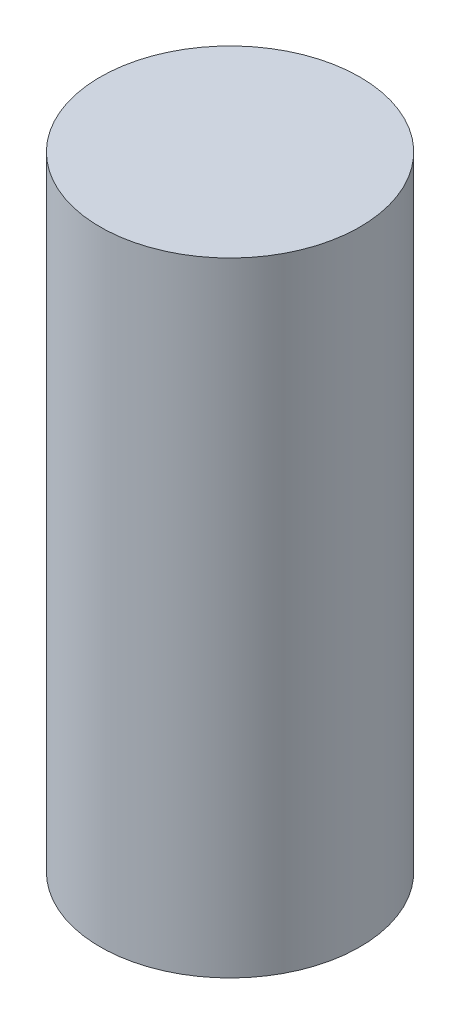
ISO-10303-21;
HEADER;
FILE_DESCRIPTION(('STEP AP214'),'2;1');
FILE_NAME('part.step','',(''),(''),'','','');
FILE_SCHEMA(('AUTOMOTIVE_DESIGN { 1 0 10303 214 1 1 1 1 }'));
ENDSEC;
DATA;
#1=APPLICATION_CONTEXT('core data for automotive mechanical design processes');
#2=APPLICATION_PROTOCOL_DEFINITION('international standard','automotive_design',2000,#1);
#3=PRODUCT_CONTEXT('',#1,'mechanical');
#4=PRODUCT('Part','Part','',(#3));
#5=PRODUCT_RELATED_PRODUCT_CATEGORY('part','',(#4));
#6=PRODUCT_DEFINITION_FORMATION('','',#4);
#7=PRODUCT_DEFINITION_CONTEXT('part definition',#1,'design');
#8=PRODUCT_DEFINITION('design','',#6,#7);
#9=PRODUCT_DEFINITION_SHAPE('','',#8);
#10=(LENGTH_UNIT() NAMED_UNIT(*) SI_UNIT(.MILLI.,.METRE.));
#11=(NAMED_UNIT(*) PLANE_ANGLE_UNIT() SI_UNIT($,.RADIAN.));
#12=(NAMED_UNIT(*) SI_UNIT($,.STERADIAN.) SOLID_ANGLE_UNIT());
#13=UNCERTAINTY_MEASURE_WITH_UNIT(LENGTH_MEASURE(1.E-05),#10,'distance_accuracy_value','');
#14=(GEOMETRIC_REPRESENTATION_CONTEXT(3) GLOBAL_UNCERTAINTY_ASSIGNED_CONTEXT((#13)) GLOBAL_UNIT_ASSIGNED_CONTEXT((#10,
#11,#12)) REPRESENTATION_CONTEXT('',''));
#15=CARTESIAN_POINT('',(0.,0.,0.));
#16=DIRECTION('',(0.,0.,1.));
#17=DIRECTION('',(1.,0.,0.));
#18=AXIS2_PLACEMENT_3D('',#15,#16,#17);
#19=CARTESIAN_POINT('',(0.,38.1,0.));
#20=DIRECTION('',(0.,-1.,0.));
#21=DIRECTION('',(0.,0.,-1.));
#22=AXIS2_PLACEMENT_3D('',#19,#20,#21);
#23=CYLINDRICAL_SURFACE('',#22,7.9375);
#24=CARTESIAN_POINT('',(0.,38.1,0.));
#25=DIRECTION('',(0.,1.,0.));
#26=DIRECTION('',(0.,0.,1.));
#27=AXIS2_PLACEMENT_3D('',#24,#25,#26);
#28=CIRCLE('',#27,7.9375);
#29=CARTESIAN_POINT('',(0.,38.1,-7.9375));
#30=VERTEX_POINT('',#29);
#31=EDGE_CURVE('E10',#30,#30,#28,.T.);
#32=CARTESIAN_POINT('',(0.,0.,0.));
#33=DIRECTION('',(0.,1.,0.));
#34=DIRECTION('',(0.,0.,1.));
#35=AXIS2_PLACEMENT_3D('',#32,#33,#34);
#36=CIRCLE('',#35,7.9375);
#37=CARTESIAN_POINT('',(0.,0.,-7.9375));
#38=VERTEX_POINT('',#37);
#39=EDGE_CURVE('E35',#38,#38,#36,.T.);
#40=CARTESIAN_POINT('',(0.,38.1,-7.9375));
#41=CARTESIAN_POINT('',(0.,37.703125,-7.9375));
#42=CARTESIAN_POINT('',(0.,37.30625,-7.9375));
#43=CARTESIAN_POINT('',(0.,36.5125,-7.9375));
#44=CARTESIAN_POINT('',(0.,36.115625,-7.9375));
#45=CARTESIAN_POINT('',(0.,35.321875,-7.9375));
#46=CARTESIAN_POINT('',(0.,34.925,-7.9375));
#47=CARTESIAN_POINT('',(0.,34.13125,-7.9375));
#48=CARTESIAN_POINT('',(0.,33.734375,-7.9375));
#49=CARTESIAN_POINT('',(0.,32.940625,-7.9375));
#50=CARTESIAN_POINT('',(0.,32.54375,-7.9375));
#51=CARTESIAN_POINT('',(0.,31.75,-7.9375));
#52=CARTESIAN_POINT('',(0.,31.353125,-7.9375));
#53=CARTESIAN_POINT('',(0.,30.559375,-7.9375));
#54=CARTESIAN_POINT('',(0.,30.1625,-7.9375));
#55=CARTESIAN_POINT('',(0.,29.36875,-7.9375));
#56=CARTESIAN_POINT('',(0.,28.971875,-7.9375));
#57=CARTESIAN_POINT('',(0.,28.178125,-7.9375));
#58=CARTESIAN_POINT('',(0.,27.78125,-7.9375));
#59=CARTESIAN_POINT('',(0.,26.9875,-7.9375));
#60=CARTESIAN_POINT('',(0.,26.590625,-7.9375));
#61=CARTESIAN_POINT('',(0.,25.796875,-7.9375));
#62=CARTESIAN_POINT('',(0.,25.4,-7.9375));
#63=CARTESIAN_POINT('',(0.,24.60625,-7.9375));
#64=CARTESIAN_POINT('',(0.,24.209375,-7.9375));
#65=CARTESIAN_POINT('',(0.,23.415625,-7.9375));
#66=CARTESIAN_POINT('',(0.,23.01875,-7.9375));
#67=CARTESIAN_POINT('',(0.,22.225,-7.9375));
#68=CARTESIAN_POINT('',(0.,21.828125,-7.9375));
#69=CARTESIAN_POINT('',(0.,21.034375,-7.9375));
#70=CARTESIAN_POINT('',(0.,20.6375,-7.9375));
#71=CARTESIAN_POINT('',(0.,19.84375,-7.9375));
#72=CARTESIAN_POINT('',(0.,19.446875,-7.9375));
#73=CARTESIAN_POINT('',(0.,18.653125,-7.9375));
#74=CARTESIAN_POINT('',(0.,18.25625,-7.9375));
#75=CARTESIAN_POINT('',(0.,17.4625,-7.9375));
#76=CARTESIAN_POINT('',(0.,17.065625,-7.9375));
#77=CARTESIAN_POINT('',(0.,16.271875,-7.9375));
#78=CARTESIAN_POINT('',(0.,15.875,-7.9375));
#79=CARTESIAN_POINT('',(0.,15.08125,-7.9375));
#80=CARTESIAN_POINT('',(0.,14.684375,-7.9375));
#81=CARTESIAN_POINT('',(0.,13.890625,-7.9375));
#82=CARTESIAN_POINT('',(0.,13.49375,-7.9375));
#83=CARTESIAN_POINT('',(0.,12.7,-7.9375));
#84=CARTESIAN_POINT('',(0.,12.303125,-7.9375));
#85=CARTESIAN_POINT('',(0.,11.509375,-7.9375));
#86=CARTESIAN_POINT('',(0.,11.1125,-7.9375));
#87=CARTESIAN_POINT('',(0.,10.31875,-7.9375));
#88=CARTESIAN_POINT('',(0.,9.92187499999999,-7.9375));
#89=CARTESIAN_POINT('',(0.,9.128125,-7.9375));
#90=CARTESIAN_POINT('',(0.,8.73124999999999,-7.9375));
#91=CARTESIAN_POINT('',(0.,7.93749999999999,-7.9375));
#92=CARTESIAN_POINT('',(0.,7.54062499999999,-7.9375));
#93=CARTESIAN_POINT('',(0.,6.746875,-7.9375));
#94=CARTESIAN_POINT('',(0.,6.35,-7.9375));
#95=CARTESIAN_POINT('',(0.,5.55625,-7.9375));
#96=CARTESIAN_POINT('',(0.,5.159375,-7.9375));
#97=CARTESIAN_POINT('',(0.,4.365625,-7.9375));
#98=CARTESIAN_POINT('',(0.,3.96875,-7.9375));
#99=CARTESIAN_POINT('',(0.,3.175,-7.9375));
#100=CARTESIAN_POINT('',(0.,2.778125,-7.9375));
#101=CARTESIAN_POINT('',(0.,1.984375,-7.9375));
#102=CARTESIAN_POINT('',(0.,1.5875,-7.9375));
#103=CARTESIAN_POINT('',(0.,0.79375,-7.9375));
#104=CARTESIAN_POINT('',(0.,0.396875,-7.9375));
#105=CARTESIAN_POINT('',(0.,0.,-7.9375));
#106=B_SPLINE_CURVE_WITH_KNOTS('',3,(#40,#41,#42,#43,#44,#45,#46,#47,#48,#49,#50,#51,#52,#53,
#54,#55,#56,#57,#58,#59,#60,#61,#62,#63,#64,#65,#66,#67,#68,#69,#70,#71,#72,#73,#74,#75,#76,#77,
#78,#79,#80,#81,#82,#83,#84,#85,#86,#87,#88,#89,#90,#91,#92,#93,#94,#95,#96,#97,#98,#99,#100,
#101,#102,#103,#104,#105),.UNSPECIFIED.,.F.,.F.,(4,2,2,2,2,2,2,2,2,2,2,2,2,2,2,2,2,2,2,2,2,2,2,
2,2,2,2,2,2,2,2,2,4),(0.,1.190625,2.38125,3.571875,4.7625,5.953125,7.14375,8.334375,
9.52500000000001,10.715625,11.90625,13.096875,14.2875,15.478125,16.66875,17.859375,19.05,
20.240625,21.43125,22.621875,23.8125,25.003125,26.19375,27.384375,28.575,29.765625,30.95625,
32.146875,33.3375,34.528125,35.71875,36.909375,38.1),.UNSPECIFIED.);
#107=EDGE_CURVE('BSEAM32',#30,#38,#106,.T.);
#108=ORIENTED_EDGE('',*,*,#31,.F.);
#109=ORIENTED_EDGE('',*,*,#39,.T.);
#110=ORIENTED_EDGE('',*,*,#107,.T.);
#111=ORIENTED_EDGE('',*,*,#107,.F.);
#112=EDGE_LOOP('',(#108,#110,#109,#111));
#113=FACE_BOUND('',#112,.T.);
#114=ADVANCED_FACE('F32',(#113),#23,.T.);
#115=CARTESIAN_POINT('',(-17.6039213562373,38.1,0.));
#116=DIRECTION('',(0.,1.,0.));
#117=DIRECTION('',(0.,0.,1.));
#118=AXIS2_PLACEMENT_3D('',#115,#116,#117);
#119=PLANE('',#118);
#120=ORIENTED_EDGE('',*,*,#31,.T.);
#121=EDGE_LOOP('',(#120));
#122=FACE_BOUND('',#121,.T.);
#123=ADVANCED_FACE('F49',(#122),#119,.T.);
#124=CARTESIAN_POINT('',(-17.6039213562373,0.,0.));
#125=DIRECTION('',(0.,1.,0.));
#126=DIRECTION('',(0.,0.,1.));
#127=AXIS2_PLACEMENT_3D('',#124,#125,#126);
#128=PLANE('',#127);
#129=ORIENTED_EDGE('',*,*,#39,.F.);
#130=EDGE_LOOP('',(#129));
#131=FACE_BOUND('',#130,.T.);
#132=ADVANCED_FACE('F47',(#131),#128,.F.);
#133=CLOSED_SHELL('',(#114,#123,#132));
#134=MANIFOLD_SOLID_BREP('B2',#133);
#135=ADVANCED_BREP_SHAPE_REPRESENTATION('',(#18,#134),#14);
#136=SHAPE_DEFINITION_REPRESENTATION(#9,#135);
ENDSEC;
END-ISO-10303-21;
